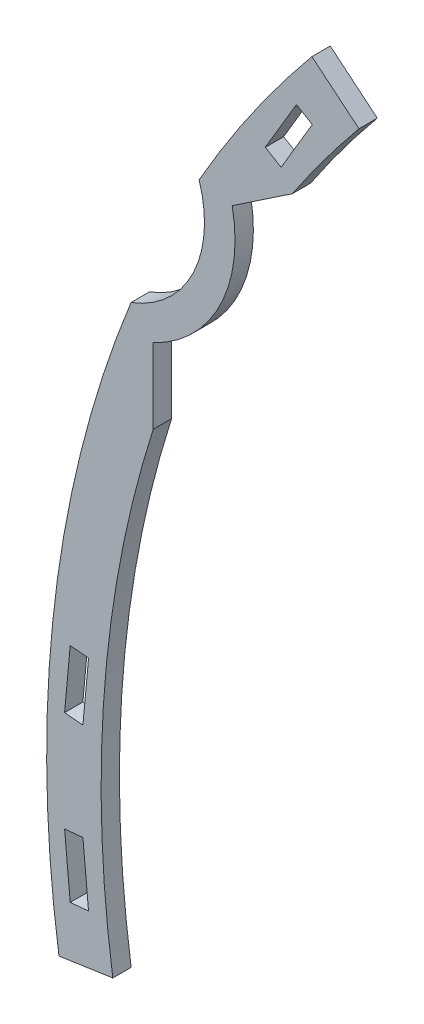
from build123d import *

# Parameters (mm, degrees)
AUFSATZ_LINEAR_AUSTRAGEN1_DEPTH = 3


with BuildPart() as part:
    # Skizze1 → Aufsatz-Linear austragen1 (new body)
    with BuildSketch(Plane.XY):
        with BuildLine():
            ThreePointArc((-175.491492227, 65.093194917), (-187.958537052, 16.61596148), (-187.283930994, -33.434156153))
            Line((-187.283930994, -33.434156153), (-178.471928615, -32.137700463))
            ThreePointArc((-178.471928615, -32.137700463), (-179.796786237, 8.775834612), (-171.863347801, 48.934683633))
            Line((-171.863347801, 48.934683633), (-171.863347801, 61.206085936))
            ThreePointArc((-171.863347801, 61.206085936), (-160.945155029, 71.924242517), (-158.939001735, 87.092009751))
            Line((-158.939001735, 87.092009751), (-149.1116013, 93.689954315))
            ThreePointArc((-149.1116013, 93.689954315), (-143.836233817, 101.16942755), (-138.186060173, 108.369952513))
            Line((-138.186060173, 108.369952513), (-145.893035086, 114.741964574))
            ThreePointArc((-145.893035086, 114.741964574), (-155.693811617, 101.79487563), (-164.34894027, 88.055476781))
            ThreePointArc((-164.34894027, 88.055476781), (-163.691233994, 85.272627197), (-163.470238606, 82.421664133))
            ThreePointArc((-163.470238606, 82.421664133), (-166.769797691, 71.876684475), (-175.491492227, 65.093194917))
        make_face()
        Polygon((-185.448587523, -24.907974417), (-186.366259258, -14.950169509), (-183.366259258, -14.673701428), (-182.448587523, -24.631506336), align=None, mode=Mode.SUBTRACT)
        Polygon((-186.366259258, 1.529250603), (-185.448587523, 11.487055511), (-182.448587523, 11.210587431), (-183.366259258, 1.252782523), align=None, mode=Mode.SUBTRACT)
        Polygon((-150.926255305, 96.534510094), (-153.518810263, 98.069141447), (-148.424957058, 106.674526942), (-145.8324021, 105.139895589), align=None, mode=Mode.SUBTRACT)
    extrude(amount=AUFSATZ_LINEAR_AUSTRAGEN1_DEPTH)


solid = part.part
